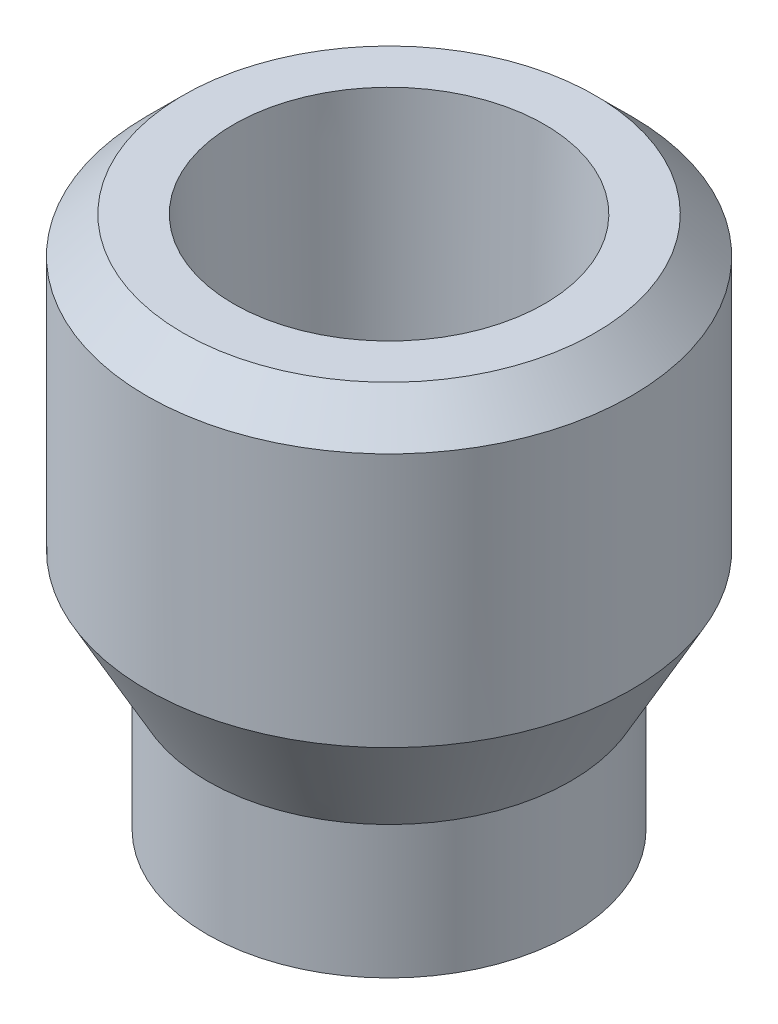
ISO-10303-21;
HEADER;
FILE_DESCRIPTION(('STEP AP214'),'2;1');
FILE_NAME('part.step','',(''),(''),'','','');
FILE_SCHEMA(('AUTOMOTIVE_DESIGN { 1 0 10303 214 1 1 1 1 }'));
ENDSEC;
DATA;
#1=APPLICATION_CONTEXT('core data for automotive mechanical design processes');
#2=APPLICATION_PROTOCOL_DEFINITION('international standard','automotive_design',2000,#1);
#3=PRODUCT_CONTEXT('',#1,'mechanical');
#4=PRODUCT('Part','Part','',(#3));
#5=PRODUCT_RELATED_PRODUCT_CATEGORY('part','',(#4));
#6=PRODUCT_DEFINITION_FORMATION('','',#4);
#7=PRODUCT_DEFINITION_CONTEXT('part definition',#1,'design');
#8=PRODUCT_DEFINITION('design','',#6,#7);
#9=PRODUCT_DEFINITION_SHAPE('','',#8);
#10=(LENGTH_UNIT() NAMED_UNIT(*) SI_UNIT(.MILLI.,.METRE.));
#11=(NAMED_UNIT(*) PLANE_ANGLE_UNIT() SI_UNIT($,.RADIAN.));
#12=(NAMED_UNIT(*) SI_UNIT($,.STERADIAN.) SOLID_ANGLE_UNIT());
#13=UNCERTAINTY_MEASURE_WITH_UNIT(LENGTH_MEASURE(1.E-05),#10,'distance_accuracy_value','');
#14=(GEOMETRIC_REPRESENTATION_CONTEXT(3) GLOBAL_UNCERTAINTY_ASSIGNED_CONTEXT((#13)) GLOBAL_UNIT_ASSIGNED_CONTEXT((#10,
#11,#12)) REPRESENTATION_CONTEXT('',''));
#15=CARTESIAN_POINT('',(0.,0.,0.));
#16=DIRECTION('',(0.,0.,1.));
#17=DIRECTION('',(1.,0.,0.));
#18=AXIS2_PLACEMENT_3D('',#15,#16,#17);
#19=CARTESIAN_POINT('',(0.,34.1,0.));
#20=DIRECTION('',(0.,-1.,0.));
#21=DIRECTION('',(0.,0.,-1.));
#22=AXIS2_PLACEMENT_3D('',#19,#20,#21);
#23=CYLINDRICAL_SURFACE('',#22,15.5);
#24=CARTESIAN_POINT('',(0.,31.775,0.));
#25=DIRECTION('',(0.,1.,0.));
#26=DIRECTION('',(0.,0.,1.));
#27=AXIS2_PLACEMENT_3D('',#24,#25,#26);
#28=CIRCLE('',#27,15.5);
#29=CARTESIAN_POINT('',(0.,31.775,15.5));
#30=VERTEX_POINT('',#29);
#31=EDGE_CURVE('E11',#30,#30,#28,.F.);
#32=ORIENTED_EDGE('',*,*,#31,.T.);
#33=EDGE_LOOP('',(#32));
#34=FACE_BOUND('',#33,.T.);
#35=CARTESIAN_POINT('',(0.,15.5,0.));
#36=DIRECTION('',(0.,-1.,0.));
#37=DIRECTION('',(0.,0.,-1.));
#38=AXIS2_PLACEMENT_3D('',#35,#36,#37);
#39=CIRCLE('',#38,15.5);
#40=CARTESIAN_POINT('',(0.,15.5,-15.5));
#41=VERTEX_POINT('',#40);
#42=EDGE_CURVE('E51',#41,#41,#39,.T.);
#43=ORIENTED_EDGE('',*,*,#42,.F.);
#44=EDGE_LOOP('',(#43));
#45=FACE_BOUND('',#44,.T.);
#46=ADVANCED_FACE('F34',(#34,#45),#23,.T.);
#47=CARTESIAN_POINT('',(0.,34.1,0.));
#48=DIRECTION('',(0.,1.,0.));
#49=DIRECTION('',(0.,0.,1.));
#50=AXIS2_PLACEMENT_3D('',#47,#48,#49);
#51=PLANE('',#50);
#52=CARTESIAN_POINT('',(0.,34.1,0.));
#53=DIRECTION('',(0.,1.,0.));
#54=DIRECTION('',(0.,0.,1.));
#55=AXIS2_PLACEMENT_3D('',#52,#53,#54);
#56=CIRCLE('',#55,9.9438079);
#57=CARTESIAN_POINT('',(0.,34.1,9.9438079));
#58=VERTEX_POINT('',#57);
#59=EDGE_CURVE('E66',#58,#58,#56,.T.);
#60=ORIENTED_EDGE('',*,*,#59,.F.);
#61=EDGE_LOOP('',(#60));
#62=FACE_BOUND('',#61,.T.);
#63=CARTESIAN_POINT('',(0.,34.1,0.));
#64=DIRECTION('',(0.,1.,0.));
#65=DIRECTION('',(0.,0.,1.));
#66=AXIS2_PLACEMENT_3D('',#63,#64,#65);
#67=CIRCLE('',#66,13.175);
#68=CARTESIAN_POINT('',(0.,34.1,13.175));
#69=VERTEX_POINT('',#68);
#70=EDGE_CURVE('E42',#69,#69,#67,.T.);
#71=ORIENTED_EDGE('',*,*,#70,.T.);
#72=EDGE_LOOP('',(#71));
#73=FACE_BOUND('',#72,.T.);
#74=ADVANCED_FACE('F90',(#62,#73),#51,.T.);
#75=CARTESIAN_POINT('',(0.,15.5,0.));
#76=DIRECTION('',(0.,-1.,0.));
#77=DIRECTION('',(0.,0.,-1.));
#78=AXIS2_PLACEMENT_3D('',#75,#76,#77);
#79=CYLINDRICAL_SURFACE('',#78,11.625);
#80=CARTESIAN_POINT('',(0.,8.50000000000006,0.));
#81=DIRECTION('',(0.,-1.,0.));
#82=DIRECTION('',(0.,0.,-1.));
#83=AXIS2_PLACEMENT_3D('',#80,#81,#82);
#84=CIRCLE('',#83,11.625);
#85=CARTESIAN_POINT('',(0.,8.50000000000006,-11.625));
#86=VERTEX_POINT('',#85);
#87=EDGE_CURVE('E46',#86,#86,#84,.T.);
#88=ORIENTED_EDGE('',*,*,#87,.T.);
#89=EDGE_LOOP('',(#88));
#90=FACE_BOUND('',#89,.T.);
#91=CARTESIAN_POINT('',(0.,0.,0.));
#92=DIRECTION('',(0.,-1.,0.));
#93=DIRECTION('',(0.,0.,-1.));
#94=AXIS2_PLACEMENT_3D('',#91,#92,#93);
#95=CIRCLE('',#94,11.625);
#96=CARTESIAN_POINT('',(0.,0.,-11.625));
#97=VERTEX_POINT('',#96);
#98=EDGE_CURVE('E54',#97,#97,#95,.T.);
#99=ORIENTED_EDGE('',*,*,#98,.F.);
#100=EDGE_LOOP('',(#99));
#101=FACE_BOUND('',#100,.T.);
#102=ADVANCED_FACE('F95',(#90,#101),#79,.T.);
#103=CARTESIAN_POINT('',(0.,0.,0.));
#104=DIRECTION('',(0.,1.,0.));
#105=DIRECTION('',(0.,0.,1.));
#106=AXIS2_PLACEMENT_3D('',#103,#104,#105);
#107=PLANE('',#106);
#108=CARTESIAN_POINT('',(0.,0.,0.));
#109=DIRECTION('',(0.,-1.,0.));
#110=DIRECTION('',(0.,0.,-1.));
#111=AXIS2_PLACEMENT_3D('',#108,#109,#110);
#112=CIRCLE('',#111,5.5);
#113=CARTESIAN_POINT('',(0.,0.,-5.5));
#114=VERTEX_POINT('',#113);
#115=EDGE_CURVE('E69',#114,#114,#112,.T.);
#116=ORIENTED_EDGE('',*,*,#115,.F.);
#117=EDGE_LOOP('',(#116));
#118=FACE_BOUND('',#117,.T.);
#119=ORIENTED_EDGE('',*,*,#98,.T.);
#120=EDGE_LOOP('',(#119));
#121=FACE_BOUND('',#120,.T.);
#122=ADVANCED_FACE('F100',(#118,#121),#107,.F.);
#123=CARTESIAN_POINT('',(0.,8.50000000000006,0.));
#124=DIRECTION('',(0.,1.,0.));
#125=DIRECTION('',(0.,0.,1.));
#126=AXIS2_PLACEMENT_3D('',#123,#124,#125);
#127=CONICAL_SURFACE('',#126,11.625,0.505581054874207);
#128=ORIENTED_EDGE('',*,*,#42,.T.);
#129=EDGE_LOOP('',(#128));
#130=FACE_BOUND('',#129,.T.);
#131=ORIENTED_EDGE('',*,*,#87,.F.);
#132=EDGE_LOOP('',(#131));
#133=FACE_BOUND('',#132,.T.);
#134=ADVANCED_FACE('F101',(#130,#133),#127,.T.);
#135=CARTESIAN_POINT('',(0.,34.1,0.));
#136=DIRECTION('',(0.,-1.,0.));
#137=DIRECTION('',(0.,0.,-1.));
#138=AXIS2_PLACEMENT_3D('',#135,#136,#137);
#139=CONICAL_SURFACE('',#138,13.175,0.785398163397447);
#140=ORIENTED_EDGE('',*,*,#31,.F.);
#141=EDGE_LOOP('',(#140));
#142=FACE_BOUND('',#141,.T.);
#143=ORIENTED_EDGE('',*,*,#70,.F.);
#144=EDGE_LOOP('',(#143));
#145=FACE_BOUND('',#144,.T.);
#146=ADVANCED_FACE('F36',(#142,#145),#139,.T.);
#147=CARTESIAN_POINT('',(0.,12.1,0.));
#148=DIRECTION('',(0.,1.,0.));
#149=DIRECTION('',(0.,0.,1.));
#150=AXIS2_PLACEMENT_3D('',#147,#148,#149);
#151=CONICAL_SURFACE('',#150,8.9281,1.0471975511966);
#152=CARTESIAN_POINT('',(0.,10.120785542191,0.));
#153=DIRECTION('',(0.,1.,0.));
#154=DIRECTION('',(0.,0.,1.));
#155=AXIS2_PLACEMENT_3D('',#152,#153,#154);
#156=CIRCLE('',#155,5.5);
#157=CARTESIAN_POINT('',(0.,10.120785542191,5.5));
#158=VERTEX_POINT('',#157);
#159=EDGE_CURVE('E38',#158,#158,#156,.F.);
#160=ORIENTED_EDGE('',*,*,#159,.T.);
#161=EDGE_LOOP('',(#160));
#162=FACE_BOUND('',#161,.T.);
#163=CARTESIAN_POINT('',(0.,12.1,0.));
#164=DIRECTION('',(0.,1.,0.));
#165=DIRECTION('',(0.,0.,1.));
#166=AXIS2_PLACEMENT_3D('',#163,#164,#165);
#167=CIRCLE('',#166,8.9281);
#168=CARTESIAN_POINT('',(0.,12.1,8.9281));
#169=VERTEX_POINT('',#168);
#170=EDGE_CURVE('E57',#169,#169,#167,.T.);
#171=ORIENTED_EDGE('',*,*,#170,.T.);
#172=EDGE_LOOP('',(#171));
#173=FACE_BOUND('',#172,.T.);
#174=ADVANCED_FACE('F76',(#162,#173),#151,.F.);
#175=CARTESIAN_POINT('',(0.,34.1,0.));
#176=DIRECTION('',(0.,1.,0.));
#177=DIRECTION('',(0.,0.,1.));
#178=AXIS2_PLACEMENT_3D('',#175,#176,#177);
#179=CYLINDRICAL_SURFACE('',#178,8.9281);
#180=ORIENTED_EDGE('',*,*,#170,.F.);
#181=EDGE_LOOP('',(#180));
#182=FACE_BOUND('',#181,.T.);
#183=CARTESIAN_POINT('',(0.,18.6,0.));
#184=DIRECTION('',(0.,1.,0.));
#185=DIRECTION('',(0.,0.,1.));
#186=AXIS2_PLACEMENT_3D('',#183,#184,#185);
#187=CIRCLE('',#186,8.9281);
#188=CARTESIAN_POINT('',(0.,18.6,8.9281));
#189=VERTEX_POINT('',#188);
#190=EDGE_CURVE('E60',#189,#189,#187,.T.);
#191=ORIENTED_EDGE('',*,*,#190,.T.);
#192=EDGE_LOOP('',(#191));
#193=FACE_BOUND('',#192,.T.);
#194=ADVANCED_FACE('F124',(#182,#193),#179,.F.);
#195=CARTESIAN_POINT('',(8.9281,18.6,0.));
#196=DIRECTION('',(0.,-1.,0.));
#197=DIRECTION('',(0.,0.,-1.));
#198=AXIS2_PLACEMENT_3D('',#195,#196,#197);
#199=PLANE('',#198);
#200=ORIENTED_EDGE('',*,*,#190,.F.);
#201=EDGE_LOOP('',(#200));
#202=FACE_BOUND('',#201,.T.);
#203=CARTESIAN_POINT('',(0.,18.6,0.));
#204=DIRECTION('',(0.,1.,0.));
#205=DIRECTION('',(0.,0.,1.));
#206=AXIS2_PLACEMENT_3D('',#203,#204,#205);
#207=CIRCLE('',#206,9.47971714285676);
#208=CARTESIAN_POINT('',(0.,18.6,9.47971714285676));
#209=VERTEX_POINT('',#208);
#210=EDGE_CURVE('E63',#209,#209,#207,.T.);
#211=ORIENTED_EDGE('',*,*,#210,.T.);
#212=EDGE_LOOP('',(#211));
#213=FACE_BOUND('',#212,.T.);
#214=ADVANCED_FACE('F86',(#202,#213),#199,.F.);
#215=CARTESIAN_POINT('',(0.,34.1,0.));
#216=DIRECTION('',(0.,1.,0.));
#217=DIRECTION('',(0.,0.,1.));
#218=AXIS2_PLACEMENT_3D('',#215,#216,#217);
#219=CONICAL_SURFACE('',#218,9.9438079,0.029932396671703);
#220=ORIENTED_EDGE('',*,*,#210,.F.);
#221=EDGE_LOOP('',(#220));
#222=FACE_BOUND('',#221,.T.);
#223=ORIENTED_EDGE('',*,*,#59,.T.);
#224=EDGE_LOOP('',(#223));
#225=FACE_BOUND('',#224,.T.);
#226=ADVANCED_FACE('F81',(#222,#225),#219,.F.);
#227=CARTESIAN_POINT('',(0.,34.1,0.));
#228=DIRECTION('',(0.,-1.,0.));
#229=DIRECTION('',(0.,0.,-1.));
#230=AXIS2_PLACEMENT_3D('',#227,#228,#229);
#231=CYLINDRICAL_SURFACE('',#230,5.5);
#232=ORIENTED_EDGE('',*,*,#115,.T.);
#233=EDGE_LOOP('',(#232));
#234=FACE_BOUND('',#233,.T.);
#235=ORIENTED_EDGE('',*,*,#159,.F.);
#236=EDGE_LOOP('',(#235));
#237=FACE_BOUND('',#236,.T.);
#238=ADVANCED_FACE('F79',(#234,#237),#231,.F.);
#239=CLOSED_SHELL('',(#46,#74,#102,#122,#134,#146,#174,#194,#214,#226,#238));
#240=MANIFOLD_SOLID_BREP('B2',#239);
#241=ADVANCED_BREP_SHAPE_REPRESENTATION('',(#18,#240),#14);
#242=SHAPE_DEFINITION_REPRESENTATION(#9,#241);
ENDSEC;
END-ISO-10303-21;
